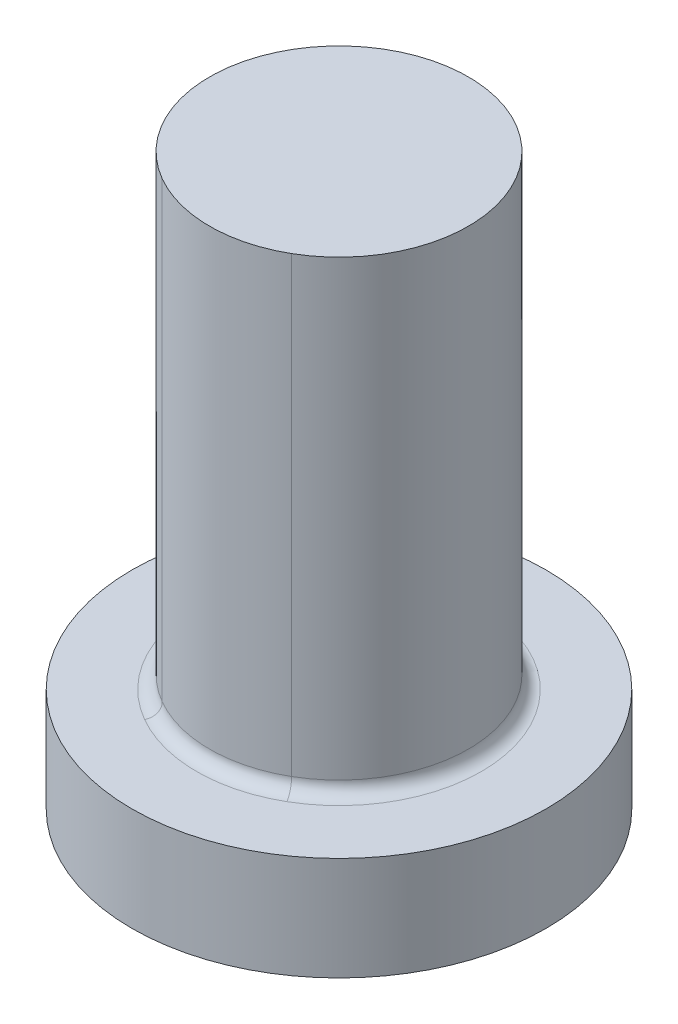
ISO-10303-21;
HEADER;
FILE_DESCRIPTION(('STEP AP214'),'2;1');
FILE_NAME('part.step','',(''),(''),'','','');
FILE_SCHEMA(('AUTOMOTIVE_DESIGN { 1 0 10303 214 1 1 1 1 }'));
ENDSEC;
DATA;
#1=APPLICATION_CONTEXT('core data for automotive mechanical design processes');
#2=APPLICATION_PROTOCOL_DEFINITION('international standard','automotive_design',2000,#1);
#3=PRODUCT_CONTEXT('',#1,'mechanical');
#4=PRODUCT('Part','Part','',(#3));
#5=PRODUCT_RELATED_PRODUCT_CATEGORY('part','',(#4));
#6=PRODUCT_DEFINITION_FORMATION('','',#4);
#7=PRODUCT_DEFINITION_CONTEXT('part definition',#1,'design');
#8=PRODUCT_DEFINITION('design','',#6,#7);
#9=PRODUCT_DEFINITION_SHAPE('','',#8);
#10=(LENGTH_UNIT() NAMED_UNIT(*) SI_UNIT(.MILLI.,.METRE.));
#11=(NAMED_UNIT(*) PLANE_ANGLE_UNIT() SI_UNIT($,.RADIAN.));
#12=(NAMED_UNIT(*) SI_UNIT($,.STERADIAN.) SOLID_ANGLE_UNIT());
#13=UNCERTAINTY_MEASURE_WITH_UNIT(LENGTH_MEASURE(1.E-05),#10,'distance_accuracy_value','');
#14=(GEOMETRIC_REPRESENTATION_CONTEXT(3) GLOBAL_UNCERTAINTY_ASSIGNED_CONTEXT((#13)) GLOBAL_UNIT_ASSIGNED_CONTEXT((#10,
#11,#12)) REPRESENTATION_CONTEXT('',''));
#15=CARTESIAN_POINT('',(0.,0.,0.));
#16=DIRECTION('',(0.,0.,1.));
#17=DIRECTION('',(1.,0.,0.));
#18=AXIS2_PLACEMENT_3D('',#15,#16,#17);
#19=CARTESIAN_POINT('',(0.,0.,0.));
#20=DIRECTION('',(0.,-1.,0.));
#21=DIRECTION('',(1.,0.,0.));
#22=AXIS2_PLACEMENT_3D('',#19,#20,#21);
#23=CYLINDRICAL_SURFACE('',#22,5.);
#24=DIRECTION('',(0.,-1.,0.));
#25=VECTOR('',#24,1.);
#26=CARTESIAN_POINT('',(2.50000000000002,0.,4.33012701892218));
#27=LINE('',#26,#25);
#28=CARTESIAN_POINT('',(2.50000000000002,22.,4.33012701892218));
#29=VERTEX_POINT('',#28);
#30=CARTESIAN_POINT('',(2.50000000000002,4.5,4.33012701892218));
#31=VERTEX_POINT('',#30);
#32=EDGE_CURVE('E71',#29,#31,#27,.T.);
#33=ORIENTED_EDGE('',*,*,#32,.T.);
#34=CARTESIAN_POINT('',(0.,4.5,0.));
#35=DIRECTION('',(0.,1.,0.));
#36=DIRECTION('',(-1.,0.,0.));
#37=AXIS2_PLACEMENT_3D('',#34,#35,#36);
#38=CIRCLE('',#37,5.);
#39=CARTESIAN_POINT('',(-2.49999999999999,4.5,4.3301270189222));
#40=VERTEX_POINT('',#39);
#41=EDGE_CURVE('E11',#31,#40,#38,.T.);
#42=ORIENTED_EDGE('',*,*,#41,.T.);
#43=DIRECTION('',(0.,-1.,0.));
#44=VECTOR('',#43,1.);
#45=CARTESIAN_POINT('',(-2.49999999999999,0.,4.3301270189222));
#46=LINE('',#45,#44);
#47=CARTESIAN_POINT('',(-2.49999999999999,22.,4.3301270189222));
#48=VERTEX_POINT('',#47);
#49=EDGE_CURVE('E78',#40,#48,#46,.F.);
#50=ORIENTED_EDGE('',*,*,#49,.T.);
#51=CARTESIAN_POINT('',(0.,22.,0.));
#52=DIRECTION('',(0.,-1.,0.));
#53=DIRECTION('',(1.,0.,0.));
#54=AXIS2_PLACEMENT_3D('',#51,#52,#53);
#55=CIRCLE('',#54,5.);
#56=EDGE_CURVE('E81',#48,#29,#55,.T.);
#57=ORIENTED_EDGE('',*,*,#56,.T.);
#58=EDGE_LOOP('',(#33,#42,#50,#57));
#59=FACE_BOUND('',#58,.T.);
#60=ADVANCED_FACE('F36',(#59),#23,.T.);
#61=CARTESIAN_POINT('',(0.,0.,0.));
#62=DIRECTION('',(0.,-1.,0.));
#63=DIRECTION('',(1.,0.,0.));
#64=AXIS2_PLACEMENT_3D('',#61,#62,#63);
#65=PLANE('',#64);
#66=CARTESIAN_POINT('',(0.,0.,0.));
#67=DIRECTION('',(0.,-1.,0.));
#68=DIRECTION('',(1.,0.,0.));
#69=AXIS2_PLACEMENT_3D('',#66,#67,#68);
#70=CIRCLE('',#69,8.);
#71=CARTESIAN_POINT('',(8.,0.,0.));
#72=VERTEX_POINT('',#71);
#73=EDGE_CURVE('E87',#72,#72,#70,.T.);
#74=ORIENTED_EDGE('',*,*,#73,.T.);
#75=EDGE_LOOP('',(#74));
#76=FACE_BOUND('',#75,.T.);
#77=ADVANCED_FACE('F38',(#76),#65,.T.);
#78=CARTESIAN_POINT('',(0.,0.,0.));
#79=DIRECTION('',(0.,-1.,0.));
#80=DIRECTION('',(1.,0.,0.));
#81=AXIS2_PLACEMENT_3D('',#78,#79,#80);
#82=CYLINDRICAL_SURFACE('',#81,8.);
#83=CARTESIAN_POINT('',(0.,4.,0.));
#84=DIRECTION('',(0.,-1.,0.));
#85=DIRECTION('',(1.,0.,0.));
#86=AXIS2_PLACEMENT_3D('',#83,#84,#85);
#87=CIRCLE('',#86,8.);
#88=CARTESIAN_POINT('',(8.,4.,0.));
#89=VERTEX_POINT('',#88);
#90=EDGE_CURVE('E85',#89,#89,#87,.T.);
#91=ORIENTED_EDGE('',*,*,#90,.T.);
#92=EDGE_LOOP('',(#91));
#93=FACE_BOUND('',#92,.T.);
#94=ORIENTED_EDGE('',*,*,#73,.F.);
#95=EDGE_LOOP('',(#94));
#96=FACE_BOUND('',#95,.T.);
#97=ADVANCED_FACE('F120',(#93,#96),#82,.T.);
#98=CARTESIAN_POINT('',(8.,4.,0.));
#99=DIRECTION('',(0.,1.,0.));
#100=DIRECTION('',(-1.,0.,0.));
#101=AXIS2_PLACEMENT_3D('',#98,#99,#100);
#102=PLANE('',#101);
#103=CARTESIAN_POINT('',(0.,4.,0.));
#104=DIRECTION('',(0.,1.,0.));
#105=DIRECTION('',(-1.,0.,0.));
#106=AXIS2_PLACEMENT_3D('',#103,#104,#105);
#107=CIRCLE('',#106,5.5);
#108=CARTESIAN_POINT('',(-2.74999999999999,4.,4.76313972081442));
#109=VERTEX_POINT('',#108);
#110=CARTESIAN_POINT('',(2.75000000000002,4.,4.7631397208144));
#111=VERTEX_POINT('',#110);
#112=EDGE_CURVE('E77',#109,#111,#107,.F.);
#113=ORIENTED_EDGE('',*,*,#112,.T.);
#114=CARTESIAN_POINT('',(0.,4.,0.));
#115=DIRECTION('',(0.,1.,0.));
#116=DIRECTION('',(-1.,0.,0.));
#117=AXIS2_PLACEMENT_3D('',#114,#115,#116);
#118=CIRCLE('',#117,5.5);
#119=EDGE_CURVE('E97',#111,#109,#118,.F.);
#120=ORIENTED_EDGE('',*,*,#119,.T.);
#121=EDGE_LOOP('',(#113,#120));
#122=FACE_BOUND('',#121,.T.);
#123=ORIENTED_EDGE('',*,*,#90,.F.);
#124=EDGE_LOOP('',(#123));
#125=FACE_BOUND('',#124,.T.);
#126=ADVANCED_FACE('F100',(#122,#125),#102,.T.);
#127=ORIENTED_EDGE('',*,*,#49,.F.);
#128=CARTESIAN_POINT('',(0.,4.5,0.));
#129=DIRECTION('',(0.,1.,0.));
#130=DIRECTION('',(-1.,0.,0.));
#131=AXIS2_PLACEMENT_3D('',#128,#129,#130);
#132=CIRCLE('',#131,5.);
#133=EDGE_CURVE('E44',#40,#31,#132,.T.);
#134=ORIENTED_EDGE('',*,*,#133,.T.);
#135=ORIENTED_EDGE('',*,*,#32,.F.);
#136=EDGE_CURVE('E75',#29,#48,#55,.T.);
#137=ORIENTED_EDGE('',*,*,#136,.T.);
#138=EDGE_LOOP('',(#127,#134,#135,#137));
#139=FACE_BOUND('',#138,.T.);
#140=ADVANCED_FACE('F73',(#139),#23,.T.);
#141=CARTESIAN_POINT('',(5.,22.,0.));
#142=DIRECTION('',(0.,1.,0.));
#143=DIRECTION('',(-1.,0.,0.));
#144=AXIS2_PLACEMENT_3D('',#141,#142,#143);
#145=PLANE('',#144);
#146=ORIENTED_EDGE('',*,*,#136,.F.);
#147=ORIENTED_EDGE('',*,*,#56,.F.);
#148=EDGE_LOOP('',(#146,#147));
#149=FACE_BOUND('',#148,.T.);
#150=ADVANCED_FACE('F84',(#149),#145,.T.);
#151=CARTESIAN_POINT('',(0.,4.5,0.));
#152=DIRECTION('',(0.,1.,0.));
#153=DIRECTION('',(-1.,0.,0.));
#154=AXIS2_PLACEMENT_3D('',#151,#152,#153);
#155=TOROIDAL_SURFACE('',#154,5.5,0.5);
#156=CARTESIAN_POINT('',(-2.74999999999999,4.5,4.76313972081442));
#157=DIRECTION('',(-0.86602540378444,0.,-0.499999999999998));
#158=DIRECTION('',(-0.499999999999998,0.,0.86602540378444));
#159=AXIS2_PLACEMENT_3D('',#156,#157,#158);
#160=CIRCLE('',#159,0.5);
#161=EDGE_CURVE('E105',#40,#109,#160,.T.);
#162=ORIENTED_EDGE('',*,*,#161,.F.);
#163=ORIENTED_EDGE('',*,*,#41,.F.);
#164=CARTESIAN_POINT('',(2.75000000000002,4.5,4.7631397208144));
#165=DIRECTION('',(0.866025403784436,0.,-0.500000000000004));
#166=DIRECTION('',(-0.500000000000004,0.,-0.866025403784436));
#167=AXIS2_PLACEMENT_3D('',#164,#165,#166);
#168=CIRCLE('',#167,0.5);
#169=EDGE_CURVE('E57',#111,#31,#168,.T.);
#170=ORIENTED_EDGE('',*,*,#169,.F.);
#171=ORIENTED_EDGE('',*,*,#112,.F.);
#172=EDGE_LOOP('',(#162,#163,#170,#171));
#173=FACE_BOUND('',#172,.T.);
#174=ADVANCED_FACE('F107',(#173),#155,.F.);
#175=CARTESIAN_POINT('',(0.,4.5,0.));
#176=DIRECTION('',(0.,1.,0.));
#177=DIRECTION('',(-1.,0.,0.));
#178=AXIS2_PLACEMENT_3D('',#175,#176,#177);
#179=TOROIDAL_SURFACE('',#178,5.5,0.5);
#180=ORIENTED_EDGE('',*,*,#169,.T.);
#181=ORIENTED_EDGE('',*,*,#133,.F.);
#182=ORIENTED_EDGE('',*,*,#161,.T.);
#183=ORIENTED_EDGE('',*,*,#119,.F.);
#184=EDGE_LOOP('',(#180,#181,#182,#183));
#185=FACE_BOUND('',#184,.T.);
#186=ADVANCED_FACE('F103',(#185),#179,.F.);
#187=CLOSED_SHELL('',(#60,#77,#97,#126,#140,#150,#174,#186));
#188=MANIFOLD_SOLID_BREP('B2',#187);
#189=ADVANCED_BREP_SHAPE_REPRESENTATION('',(#18,#188),#14);
#190=SHAPE_DEFINITION_REPRESENTATION(#9,#189);
ENDSEC;
END-ISO-10303-21;
